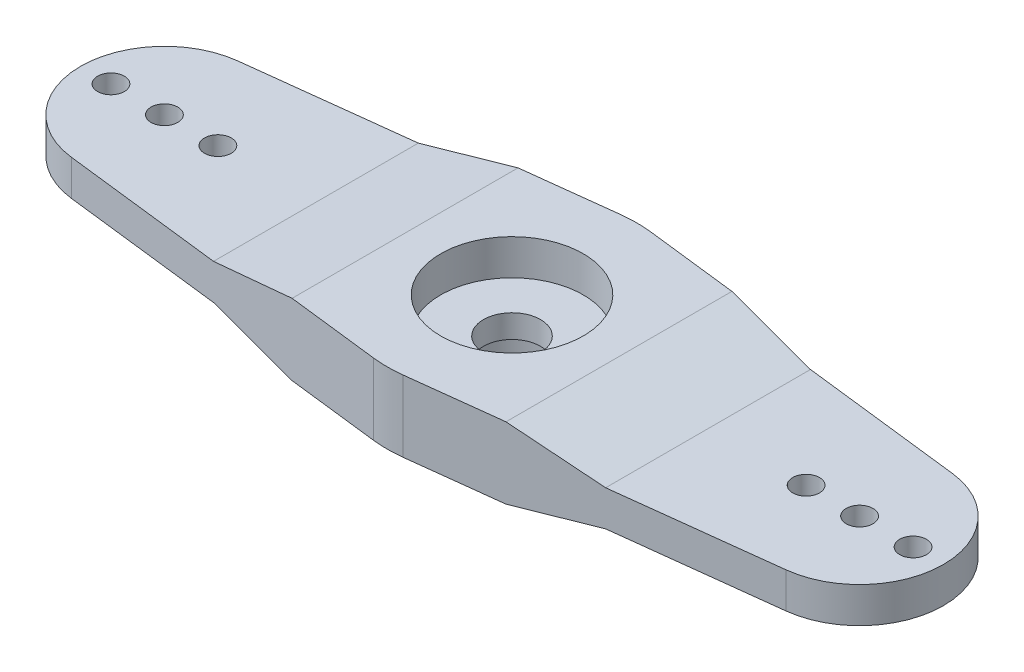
ISO-10303-21;
HEADER;
FILE_DESCRIPTION(('STEP AP214'),'2;1');
FILE_NAME('part.step','',(''),(''),'','','');
FILE_SCHEMA(('AUTOMOTIVE_DESIGN { 1 0 10303 214 1 1 1 1 }'));
ENDSEC;
DATA;
#1=APPLICATION_CONTEXT('core data for automotive mechanical design processes');
#2=APPLICATION_PROTOCOL_DEFINITION('international standard','automotive_design',2000,#1);
#3=PRODUCT_CONTEXT('',#1,'mechanical');
#4=PRODUCT('Part','Part','',(#3));
#5=PRODUCT_RELATED_PRODUCT_CATEGORY('part','',(#4));
#6=PRODUCT_DEFINITION_FORMATION('','',#4);
#7=PRODUCT_DEFINITION_CONTEXT('part definition',#1,'design');
#8=PRODUCT_DEFINITION('design','',#6,#7);
#9=PRODUCT_DEFINITION_SHAPE('','',#8);
#10=(LENGTH_UNIT() NAMED_UNIT(*) SI_UNIT(.MILLI.,.METRE.));
#11=(NAMED_UNIT(*) PLANE_ANGLE_UNIT() SI_UNIT($,.RADIAN.));
#12=(NAMED_UNIT(*) SI_UNIT($,.STERADIAN.) SOLID_ANGLE_UNIT());
#13=UNCERTAINTY_MEASURE_WITH_UNIT(LENGTH_MEASURE(1.E-05),#10,'distance_accuracy_value','');
#14=(GEOMETRIC_REPRESENTATION_CONTEXT(3) GLOBAL_UNCERTAINTY_ASSIGNED_CONTEXT((#13)) GLOBAL_UNIT_ASSIGNED_CONTEXT((#10,
#11,#12)) REPRESENTATION_CONTEXT('',''));
#15=CARTESIAN_POINT('',(0.,0.,0.));
#16=DIRECTION('',(0.,0.,1.));
#17=DIRECTION('',(1.,0.,0.));
#18=AXIS2_PLACEMENT_3D('',#15,#16,#17);
#19=CARTESIAN_POINT('',(0.823529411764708,0.,8.04861169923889));
#20=DIRECTION('',(0.117647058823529,0.,-0.993055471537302));
#21=DIRECTION('',(-0.993055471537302,0.,-0.117647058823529));
#22=AXIS2_PLACEMENT_3D('',#19,#20,#21);
#23=PLANE('',#22);
#24=DIRECTION('',(0.993055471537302,0.,0.117647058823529));
#25=VECTOR('',#24,1.);
#26=CARTESIAN_POINT('',(13.4237311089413,3.,9.54135476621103));
#27=LINE('',#26,#25);
#28=CARTESIAN_POINT('',(11.,3.,9.25421588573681));
#29=VERTEX_POINT('',#28);
#30=CARTESIAN_POINT('',(20.0536332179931,3.,10.3267977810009));
#31=VERTEX_POINT('',#30);
#32=EDGE_CURVE('E160',#29,#31,#27,.T.);
#33=ORIENTED_EDGE('',*,*,#32,.T.);
#34=DIRECTION('',(0.,1.,0.));
#35=VECTOR('',#34,1.);
#36=CARTESIAN_POINT('',(20.0536332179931,-2.,10.3267977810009));
#37=LINE('',#36,#35);
#38=CARTESIAN_POINT('',(20.0536332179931,1.,10.3267977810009));
#39=VERTEX_POINT('',#38);
#40=EDGE_CURVE('E147',#39,#31,#37,.T.);
#41=ORIENTED_EDGE('',*,*,#40,.F.);
#42=DIRECTION('',(-0.993055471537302,0.,-0.117647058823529));
#43=VECTOR('',#42,1.);
#44=CARTESIAN_POINT('',(13.4237311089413,1.,9.54135476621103));
#45=LINE('',#44,#43);
#46=CARTESIAN_POINT('',(11.,1.,9.2542158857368));
#47=VERTEX_POINT('',#46);
#48=EDGE_CURVE('E166',#39,#47,#45,.T.);
#49=ORIENTED_EDGE('',*,*,#48,.T.);
#50=DIRECTION('',(-0.974030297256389,-0.194806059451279,-0.115393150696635));
#51=VECTOR('',#50,1.);
#52=CARTESIAN_POINT('',(13.3317519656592,1.46635039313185,9.53045801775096));
#53=LINE('',#52,#51);
#54=CARTESIAN_POINT('',(5.99999999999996,0.,8.66186700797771));
#55=VERTEX_POINT('',#54);
#56=EDGE_CURVE('E168',#47,#55,#53,.T.);
#57=ORIENTED_EDGE('',*,*,#56,.T.);
#58=DIRECTION('',(-0.993055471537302,0.,-0.117647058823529));
#59=VECTOR('',#58,1.);
#60=CARTESIAN_POINT('',(0.823529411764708,0.,8.04861169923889));
#61=LINE('',#60,#59);
#62=CARTESIAN_POINT('',(0.823529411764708,0.,8.04861169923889));
#63=VERTEX_POINT('',#62);
#64=EDGE_CURVE('E326',#55,#63,#61,.T.);
#65=ORIENTED_EDGE('',*,*,#64,.T.);
#66=DIRECTION('',(0.,1.,0.));
#67=VECTOR('',#66,1.);
#68=CARTESIAN_POINT('',(0.823529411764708,0.,8.04861169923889));
#69=LINE('',#68,#67);
#70=CARTESIAN_POINT('',(0.823529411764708,4.,8.04861169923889));
#71=VERTEX_POINT('',#70);
#72=EDGE_CURVE('E278',#63,#71,#69,.T.);
#73=ORIENTED_EDGE('',*,*,#72,.T.);
#74=DIRECTION('',(-0.993055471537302,0.,-0.117647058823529));
#75=VECTOR('',#74,1.);
#76=CARTESIAN_POINT('',(0.823529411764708,4.,8.04861169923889));
#77=LINE('',#76,#75);
#78=CARTESIAN_POINT('',(6.,4.,8.66186700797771));
#79=VERTEX_POINT('',#78);
#80=EDGE_CURVE('E291',#79,#71,#77,.T.);
#81=ORIENTED_EDGE('',*,*,#80,.F.);
#82=DIRECTION('',(0.974030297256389,-0.194806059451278,0.115393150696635));
#83=VECTOR('',#82,1.);
#84=CARTESIAN_POINT('',(8.39832986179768,3.52033402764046,8.94599660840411));
#85=LINE('',#84,#83);
#86=EDGE_CURVE('E165',#79,#29,#85,.T.);
#87=ORIENTED_EDGE('',*,*,#86,.T.);
#88=EDGE_LOOP('',(#33,#41,#49,#57,#65,#73,#81,#87));
#89=FACE_BOUND('',#88,.T.);
#90=ADVANCED_FACE('F37',(#89),#23,.T.);
#91=CARTESIAN_POINT('',(-0.823529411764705,0.,21.9513883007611));
#92=DIRECTION('',(-0.117647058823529,0.,0.993055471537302));
#93=DIRECTION('',(0.993055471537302,0.,0.117647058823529));
#94=AXIS2_PLACEMENT_3D('',#91,#92,#93);
#95=PLANE('',#94);
#96=DIRECTION('',(-0.993055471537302,0.,-0.117647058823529));
#97=VECTOR('',#96,1.);
#98=CARTESIAN_POINT('',(-28.6558536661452,3.,18.6540990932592));
#99=LINE('',#98,#97);
#100=CARTESIAN_POINT('',(-11.,3.,20.7457841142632));
#101=VERTEX_POINT('',#100);
#102=CARTESIAN_POINT('',(-20.0536332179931,3.,19.6732022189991));
#103=VERTEX_POINT('',#102);
#104=EDGE_CURVE('E188',#101,#103,#99,.T.);
#105=ORIENTED_EDGE('',*,*,#104,.T.);
#106=DIRECTION('',(0.,1.,0.));
#107=VECTOR('',#106,1.);
#108=CARTESIAN_POINT('',(-20.0536332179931,-2.,19.6732022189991));
#109=LINE('',#108,#107);
#110=CARTESIAN_POINT('',(-20.0536332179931,1.,19.6732022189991));
#111=VERTEX_POINT('',#110);
#112=EDGE_CURVE('E362',#111,#103,#109,.T.);
#113=ORIENTED_EDGE('',*,*,#112,.F.);
#114=DIRECTION('',(0.993055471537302,0.,0.117647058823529));
#115=VECTOR('',#114,1.);
#116=CARTESIAN_POINT('',(-28.6558536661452,1.,18.6540990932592));
#117=LINE('',#116,#115);
#118=CARTESIAN_POINT('',(-11.,1.,20.7457841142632));
#119=VERTEX_POINT('',#118);
#120=EDGE_CURVE('E186',#111,#119,#117,.T.);
#121=ORIENTED_EDGE('',*,*,#120,.T.);
#122=DIRECTION('',(0.974030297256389,-0.194806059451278,0.115393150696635));
#123=VECTOR('',#122,1.);
#124=CARTESIAN_POINT('',(-5.02643711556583,-0.194712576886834,21.4534707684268));
#125=LINE('',#124,#123);
#126=CARTESIAN_POINT('',(-6.,0.,21.3381329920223));
#127=VERTEX_POINT('',#126);
#128=EDGE_CURVE('E184',#119,#127,#125,.T.);
#129=ORIENTED_EDGE('',*,*,#128,.T.);
#130=DIRECTION('',(0.993055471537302,0.,0.117647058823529));
#131=VECTOR('',#130,1.);
#132=CARTESIAN_POINT('',(-0.823529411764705,0.,21.9513883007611));
#133=LINE('',#132,#131);
#134=CARTESIAN_POINT('',(-0.823529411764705,0.,21.9513883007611));
#135=VERTEX_POINT('',#134);
#136=EDGE_CURVE('E270',#127,#135,#133,.T.);
#137=ORIENTED_EDGE('',*,*,#136,.T.);
#138=DIRECTION('',(0.,1.,0.));
#139=VECTOR('',#138,1.);
#140=CARTESIAN_POINT('',(-0.823529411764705,0.,21.9513883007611));
#141=LINE('',#140,#139);
#142=CARTESIAN_POINT('',(-0.823529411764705,4.,21.9513883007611));
#143=VERTEX_POINT('',#142);
#144=EDGE_CURVE('E303',#135,#143,#141,.T.);
#145=ORIENTED_EDGE('',*,*,#144,.T.);
#146=DIRECTION('',(0.993055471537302,0.,0.117647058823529));
#147=VECTOR('',#146,1.);
#148=CARTESIAN_POINT('',(-0.823529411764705,4.,21.9513883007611));
#149=LINE('',#148,#147);
#150=CARTESIAN_POINT('',(-6.,4.,21.3381329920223));
#151=VERTEX_POINT('',#150);
#152=EDGE_CURVE('E300',#151,#143,#149,.T.);
#153=ORIENTED_EDGE('',*,*,#152,.F.);
#154=DIRECTION('',(-0.974030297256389,-0.194806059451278,-0.115393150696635));
#155=VECTOR('',#154,1.);
#156=CARTESIAN_POINT('',(-9.95985921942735,3.20802815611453,20.8690093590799));
#157=LINE('',#156,#155);
#158=EDGE_CURVE('E191',#151,#101,#157,.T.);
#159=ORIENTED_EDGE('',*,*,#158,.T.);
#160=EDGE_LOOP('',(#105,#113,#121,#129,#137,#145,#153,#159));
#161=FACE_BOUND('',#160,.T.);
#162=ADVANCED_FACE('F377',(#161),#95,.T.);
#163=CARTESIAN_POINT('',(-6.,0.,30.));
#164=DIRECTION('',(0.,1.,0.));
#165=DIRECTION('',(0.,0.,1.));
#166=AXIS2_PLACEMENT_3D('',#163,#164,#165);
#167=PLANE('',#166);
#168=DIRECTION('',(-0.993055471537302,0.,0.117647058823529));
#169=VECTOR('',#168,1.);
#170=CARTESIAN_POINT('',(-25.9705882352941,0.,11.0277781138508));
#171=LINE('',#170,#169);
#172=CARTESIAN_POINT('',(-0.823529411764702,0.,8.04861169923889));
#173=VERTEX_POINT('',#172);
#174=CARTESIAN_POINT('',(-6.,0.,8.66186700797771));
#175=VERTEX_POINT('',#174);
#176=EDGE_CURVE('E259',#173,#175,#171,.T.);
#177=ORIENTED_EDGE('',*,*,#176,.F.);
#178=CARTESIAN_POINT('',(0.,0.,15.));
#179=DIRECTION('',(0.,1.,0.));
#180=DIRECTION('',(0.,0.,1.));
#181=AXIS2_PLACEMENT_3D('',#178,#179,#180);
#182=CIRCLE('',#181,7.);
#183=EDGE_CURVE('E280',#63,#173,#182,.T.);
#184=ORIENTED_EDGE('',*,*,#183,.F.);
#185=ORIENTED_EDGE('',*,*,#64,.F.);
#186=DIRECTION('',(0.,0.,-1.));
#187=VECTOR('',#186,1.);
#188=CARTESIAN_POINT('',(6.,0.,30.));
#189=LINE('',#188,#187);
#190=CARTESIAN_POINT('',(6.00000000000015,0.,21.3381329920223));
#191=VERTEX_POINT('',#190);
#192=EDGE_CURVE('E204',#191,#55,#189,.T.);
#193=ORIENTED_EDGE('',*,*,#192,.F.);
#194=DIRECTION('',(0.993055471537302,0.,-0.117647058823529));
#195=VECTOR('',#194,1.);
#196=CARTESIAN_POINT('',(25.9705882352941,0.,18.9722218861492));
#197=LINE('',#196,#195);
#198=CARTESIAN_POINT('',(0.823529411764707,0.,21.9513883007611));
#199=VERTEX_POINT('',#198);
#200=EDGE_CURVE('E317',#199,#191,#197,.T.);
#201=ORIENTED_EDGE('',*,*,#200,.F.);
#202=CARTESIAN_POINT('',(0.,0.,15.));
#203=DIRECTION('',(0.,1.,0.));
#204=DIRECTION('',(0.,0.,1.));
#205=AXIS2_PLACEMENT_3D('',#202,#203,#204);
#206=CIRCLE('',#205,7.);
#207=EDGE_CURVE('E273',#135,#199,#206,.T.);
#208=ORIENTED_EDGE('',*,*,#207,.F.);
#209=ORIENTED_EDGE('',*,*,#136,.F.);
#210=DIRECTION('',(0.,0.,-1.));
#211=VECTOR('',#210,1.);
#212=CARTESIAN_POINT('',(-6.,0.,30.));
#213=LINE('',#212,#211);
#214=EDGE_CURVE('E207',#127,#175,#213,.T.);
#215=ORIENTED_EDGE('',*,*,#214,.T.);
#216=EDGE_LOOP('',(#177,#184,#185,#193,#201,#208,#209,#215));
#217=FACE_BOUND('',#216,.T.);
#218=CARTESIAN_POINT('',(0.,0.,15.));
#219=DIRECTION('',(0.,1.,0.));
#220=DIRECTION('',(0.,0.,1.));
#221=AXIS2_PLACEMENT_3D('',#218,#219,#220);
#222=CIRCLE('',#221,5.);
#223=CARTESIAN_POINT('',(0.,0.,20.));
#224=VERTEX_POINT('',#223);
#225=EDGE_CURVE('E216',#224,#224,#222,.F.);
#226=ORIENTED_EDGE('',*,*,#225,.F.);
#227=EDGE_LOOP('',(#226));
#228=FACE_BOUND('',#227,.T.);
#229=ADVANCED_FACE('F266',(#217,#228),#167,.F.);
#230=CARTESIAN_POINT('',(-30.,3.,30.));
#231=DIRECTION('',(0.,-1.,0.));
#232=DIRECTION('',(0.,0.,-1.));
#233=AXIS2_PLACEMENT_3D('',#230,#231,#232);
#234=PLANE('',#233);
#235=CARTESIAN_POINT('',(-22.5,3.,15.));
#236=DIRECTION('',(0.,1.,0.));
#237=DIRECTION('',(0.,0.,1.));
#238=AXIS2_PLACEMENT_3D('',#235,#236,#237);
#239=CIRCLE('',#238,0.750000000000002);
#240=CARTESIAN_POINT('',(-22.5,3.,15.75));
#241=VERTEX_POINT('',#240);
#242=EDGE_CURVE('E231',#241,#241,#239,.T.);
#243=ORIENTED_EDGE('',*,*,#242,.F.);
#244=EDGE_LOOP('',(#243));
#245=FACE_BOUND('',#244,.T.);
#246=CARTESIAN_POINT('',(-19.5,3.,15.));
#247=DIRECTION('',(0.,1.,0.));
#248=DIRECTION('',(0.,0.,1.));
#249=AXIS2_PLACEMENT_3D('',#246,#247,#248);
#250=CIRCLE('',#249,0.750000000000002);
#251=CARTESIAN_POINT('',(-19.5,3.,15.75));
#252=VERTEX_POINT('',#251);
#253=EDGE_CURVE('E227',#252,#252,#250,.T.);
#254=ORIENTED_EDGE('',*,*,#253,.F.);
#255=EDGE_LOOP('',(#254));
#256=FACE_BOUND('',#255,.T.);
#257=CARTESIAN_POINT('',(-16.5,3.,15.));
#258=DIRECTION('',(0.,1.,0.));
#259=DIRECTION('',(0.,0.,1.));
#260=AXIS2_PLACEMENT_3D('',#257,#258,#259);
#261=CIRCLE('',#260,0.750000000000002);
#262=CARTESIAN_POINT('',(-16.5,3.,15.75));
#263=VERTEX_POINT('',#262);
#264=EDGE_CURVE('E223',#263,#263,#261,.T.);
#265=ORIENTED_EDGE('',*,*,#264,.F.);
#266=EDGE_LOOP('',(#265));
#267=FACE_BOUND('',#266,.T.);
#268=DIRECTION('',(0.993055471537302,0.,-0.117647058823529));
#269=VECTOR('',#268,1.);
#270=CARTESIAN_POINT('',(-32.1607553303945,3.,11.7611258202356));
#271=LINE('',#270,#269);
#272=CARTESIAN_POINT('',(-20.0536332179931,3.,10.3267977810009));
#273=VERTEX_POINT('',#272);
#274=CARTESIAN_POINT('',(-11.,3.,9.2542158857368));
#275=VERTEX_POINT('',#274);
#276=EDGE_CURVE('E180',#273,#275,#271,.T.);
#277=ORIENTED_EDGE('',*,*,#276,.F.);
#278=CARTESIAN_POINT('',(-19.5,3.,15.));
#279=DIRECTION('',(0.,-1.,0.));
#280=DIRECTION('',(0.,0.,1.));
#281=AXIS2_PLACEMENT_3D('',#278,#279,#280);
#282=CIRCLE('',#281,4.70588235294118);
#283=EDGE_CURVE('E364',#103,#273,#282,.T.);
#284=ORIENTED_EDGE('',*,*,#283,.F.);
#285=ORIENTED_EDGE('',*,*,#104,.F.);
#286=DIRECTION('',(0.,0.,-1.));
#287=VECTOR('',#286,1.);
#288=CARTESIAN_POINT('',(-11.,3.,30.));
#289=LINE('',#288,#287);
#290=EDGE_CURVE('E213',#101,#275,#289,.T.);
#291=ORIENTED_EDGE('',*,*,#290,.T.);
#292=EDGE_LOOP('',(#277,#284,#285,#291));
#293=FACE_BOUND('',#292,.T.);
#294=ADVANCED_FACE('F387',(#245,#256,#267,#293),#234,.F.);
#295=CARTESIAN_POINT('',(-6.,4.,30.));
#296=DIRECTION('',(0.,-1.,0.));
#297=DIRECTION('',(0.,0.,-1.));
#298=AXIS2_PLACEMENT_3D('',#295,#296,#297);
#299=PLANE('',#298);
#300=CARTESIAN_POINT('',(0.,4.,15.));
#301=DIRECTION('',(0.,1.,0.));
#302=DIRECTION('',(0.,0.,1.));
#303=AXIS2_PLACEMENT_3D('',#300,#301,#302);
#304=CIRCLE('',#303,4.);
#305=CARTESIAN_POINT('',(0.,4.,19.));
#306=VERTEX_POINT('',#305);
#307=EDGE_CURVE('E333',#306,#306,#304,.T.);
#308=ORIENTED_EDGE('',*,*,#307,.F.);
#309=EDGE_LOOP('',(#308));
#310=FACE_BOUND('',#309,.T.);
#311=DIRECTION('',(-0.993055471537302,0.,0.117647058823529));
#312=VECTOR('',#311,1.);
#313=CARTESIAN_POINT('',(-25.9705882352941,4.,11.0277781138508));
#314=LINE('',#313,#312);
#315=CARTESIAN_POINT('',(-0.823529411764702,4.,8.04861169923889));
#316=VERTEX_POINT('',#315);
#317=CARTESIAN_POINT('',(-6.,4.,8.66186700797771));
#318=VERTEX_POINT('',#317);
#319=EDGE_CURVE('E297',#316,#318,#314,.T.);
#320=ORIENTED_EDGE('',*,*,#319,.T.);
#321=DIRECTION('',(0.,0.,-1.));
#322=VECTOR('',#321,1.);
#323=CARTESIAN_POINT('',(-6.,4.,30.));
#324=LINE('',#323,#322);
#325=EDGE_CURVE('E193',#151,#318,#324,.T.);
#326=ORIENTED_EDGE('',*,*,#325,.F.);
#327=ORIENTED_EDGE('',*,*,#152,.T.);
#328=CARTESIAN_POINT('',(0.,4.,15.));
#329=DIRECTION('',(0.,1.,0.));
#330=DIRECTION('',(0.,0.,1.));
#331=AXIS2_PLACEMENT_3D('',#328,#329,#330);
#332=CIRCLE('',#331,7.);
#333=CARTESIAN_POINT('',(0.823529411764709,4.,21.9513883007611));
#334=VERTEX_POINT('',#333);
#335=EDGE_CURVE('E284',#143,#334,#332,.T.);
#336=ORIENTED_EDGE('',*,*,#335,.T.);
#337=DIRECTION('',(0.993055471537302,0.,-0.117647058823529));
#338=VECTOR('',#337,1.);
#339=CARTESIAN_POINT('',(25.9705882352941,4.,18.9722218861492));
#340=LINE('',#339,#338);
#341=CARTESIAN_POINT('',(6.,4.,21.3381329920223));
#342=VERTEX_POINT('',#341);
#343=EDGE_CURVE('E287',#334,#342,#340,.T.);
#344=ORIENTED_EDGE('',*,*,#343,.T.);
#345=DIRECTION('',(0.,0.,-1.));
#346=VECTOR('',#345,1.);
#347=CARTESIAN_POINT('',(6.,4.,30.));
#348=LINE('',#347,#346);
#349=EDGE_CURVE('E196',#342,#79,#348,.T.);
#350=ORIENTED_EDGE('',*,*,#349,.T.);
#351=ORIENTED_EDGE('',*,*,#80,.T.);
#352=CARTESIAN_POINT('',(0.,4.,15.));
#353=DIRECTION('',(0.,1.,0.));
#354=DIRECTION('',(0.,0.,1.));
#355=AXIS2_PLACEMENT_3D('',#352,#353,#354);
#356=CIRCLE('',#355,7.);
#357=EDGE_CURVE('E294',#71,#316,#356,.T.);
#358=ORIENTED_EDGE('',*,*,#357,.T.);
#359=EDGE_LOOP('',(#320,#326,#327,#336,#344,#350,#351,#358));
#360=FACE_BOUND('',#359,.T.);
#361=ADVANCED_FACE('F373',(#310,#360),#299,.F.);
#362=CARTESIAN_POINT('',(6.,4.,30.));
#363=DIRECTION('',(-0.196116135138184,-0.98058067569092,0.));
#364=DIRECTION('',(0.98058067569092,-0.196116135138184,0.));
#365=AXIS2_PLACEMENT_3D('',#362,#363,#364);
#366=PLANE('',#365);
#367=ORIENTED_EDGE('',*,*,#86,.F.);
#368=ORIENTED_EDGE('',*,*,#349,.F.);
#369=DIRECTION('',(-0.974030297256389,0.194806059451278,0.115393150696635));
#370=VECTOR('',#369,1.);
#371=CARTESIAN_POINT('',(5.02643711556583,4.19471257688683,21.4534707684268));
#372=LINE('',#371,#370);
#373=CARTESIAN_POINT('',(11.,3.,20.7457841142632));
#374=VERTEX_POINT('',#373);
#375=EDGE_CURVE('E305',#374,#342,#372,.T.);
#376=ORIENTED_EDGE('',*,*,#375,.F.);
#377=DIRECTION('',(0.,0.,-1.));
#378=VECTOR('',#377,1.);
#379=CARTESIAN_POINT('',(11.,3.,30.));
#380=LINE('',#379,#378);
#381=EDGE_CURVE('E199',#374,#29,#380,.T.);
#382=ORIENTED_EDGE('',*,*,#381,.T.);
#383=EDGE_LOOP('',(#367,#368,#376,#382));
#384=FACE_BOUND('',#383,.T.);
#385=ADVANCED_FACE('F371',(#384),#366,.F.);
#386=CARTESIAN_POINT('',(11.,3.,30.));
#387=DIRECTION('',(0.,-1.,0.));
#388=DIRECTION('',(0.,0.,-1.));
#389=AXIS2_PLACEMENT_3D('',#386,#387,#388);
#390=PLANE('',#389);
#391=CARTESIAN_POINT('',(22.5,3.,15.));
#392=DIRECTION('',(0.,1.,0.));
#393=DIRECTION('',(0.,0.,1.));
#394=AXIS2_PLACEMENT_3D('',#391,#392,#393);
#395=CIRCLE('',#394,0.750000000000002);
#396=CARTESIAN_POINT('',(22.5,3.,15.75));
#397=VERTEX_POINT('',#396);
#398=EDGE_CURVE('E243',#397,#397,#395,.T.);
#399=ORIENTED_EDGE('',*,*,#398,.F.);
#400=EDGE_LOOP('',(#399));
#401=FACE_BOUND('',#400,.T.);
#402=CARTESIAN_POINT('',(19.5,3.,15.));
#403=DIRECTION('',(0.,1.,0.));
#404=DIRECTION('',(0.,0.,1.));
#405=AXIS2_PLACEMENT_3D('',#402,#403,#404);
#406=CIRCLE('',#405,0.750000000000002);
#407=CARTESIAN_POINT('',(19.5,3.,15.75));
#408=VERTEX_POINT('',#407);
#409=EDGE_CURVE('E239',#408,#408,#406,.T.);
#410=ORIENTED_EDGE('',*,*,#409,.F.);
#411=EDGE_LOOP('',(#410));
#412=FACE_BOUND('',#411,.T.);
#413=CARTESIAN_POINT('',(16.5,3.,15.));
#414=DIRECTION('',(0.,1.,0.));
#415=DIRECTION('',(0.,0.,1.));
#416=AXIS2_PLACEMENT_3D('',#413,#414,#415);
#417=CIRCLE('',#416,0.750000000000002);
#418=CARTESIAN_POINT('',(16.5,3.,15.75));
#419=VERTEX_POINT('',#418);
#420=EDGE_CURVE('E235',#419,#419,#417,.T.);
#421=ORIENTED_EDGE('',*,*,#420,.F.);
#422=EDGE_LOOP('',(#421));
#423=FACE_BOUND('',#422,.T.);
#424=DIRECTION('',(-0.993055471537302,0.,0.117647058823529));
#425=VECTOR('',#424,1.);
#426=CARTESIAN_POINT('',(9.91882944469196,3.,20.8738701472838));
#427=LINE('',#426,#425);
#428=CARTESIAN_POINT('',(20.0536332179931,3.,19.6732022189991));
#429=VERTEX_POINT('',#428);
#430=EDGE_CURVE('E162',#429,#374,#427,.T.);
#431=ORIENTED_EDGE('',*,*,#430,.F.);
#432=CARTESIAN_POINT('',(19.5,3.,15.));
#433=DIRECTION('',(0.,-1.,0.));
#434=DIRECTION('',(0.,0.,1.));
#435=AXIS2_PLACEMENT_3D('',#432,#433,#434);
#436=CIRCLE('',#435,4.70588235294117);
#437=EDGE_CURVE('E150',#31,#429,#436,.T.);
#438=ORIENTED_EDGE('',*,*,#437,.F.);
#439=ORIENTED_EDGE('',*,*,#32,.F.);
#440=ORIENTED_EDGE('',*,*,#381,.F.);
#441=EDGE_LOOP('',(#431,#438,#439,#440));
#442=FACE_BOUND('',#441,.T.);
#443=ADVANCED_FACE('F158',(#401,#412,#423,#442),#390,.F.);
#444=CARTESIAN_POINT('',(-11.,3.,30.));
#445=DIRECTION('',(0.196116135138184,-0.98058067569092,0.));
#446=DIRECTION('',(0.98058067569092,0.196116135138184,0.));
#447=AXIS2_PLACEMENT_3D('',#444,#445,#446);
#448=PLANE('',#447);
#449=ORIENTED_EDGE('',*,*,#158,.F.);
#450=ORIENTED_EDGE('',*,*,#325,.T.);
#451=DIRECTION('',(0.974030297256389,0.194806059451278,-0.115393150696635));
#452=VECTOR('',#451,1.);
#453=CARTESIAN_POINT('',(-13.3317519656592,2.53364960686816,9.53045801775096));
#454=LINE('',#453,#452);
#455=EDGE_CURVE('E182',#275,#318,#454,.T.);
#456=ORIENTED_EDGE('',*,*,#455,.F.);
#457=ORIENTED_EDGE('',*,*,#290,.F.);
#458=EDGE_LOOP('',(#449,#450,#456,#457));
#459=FACE_BOUND('',#458,.T.);
#460=ADVANCED_FACE('F39',(#459),#448,.F.);
#461=CARTESIAN_POINT('',(-25.9705882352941,0.,11.0277781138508));
#462=DIRECTION('',(-0.117647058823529,0.,-0.993055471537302));
#463=DIRECTION('',(-0.993055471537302,0.,0.117647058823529));
#464=AXIS2_PLACEMENT_3D('',#461,#462,#463);
#465=PLANE('',#464);
#466=DIRECTION('',(0.,1.,0.));
#467=VECTOR('',#466,1.);
#468=CARTESIAN_POINT('',(-20.0536332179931,-2.,10.3267977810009));
#469=LINE('',#468,#467);
#470=CARTESIAN_POINT('',(-20.0536332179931,1.,10.3267977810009));
#471=VERTEX_POINT('',#470);
#472=EDGE_CURVE('E59',#471,#273,#469,.T.);
#473=ORIENTED_EDGE('',*,*,#472,.T.);
#474=ORIENTED_EDGE('',*,*,#276,.T.);
#475=ORIENTED_EDGE('',*,*,#455,.T.);
#476=ORIENTED_EDGE('',*,*,#319,.F.);
#477=DIRECTION('',(0.,1.,0.));
#478=VECTOR('',#477,1.);
#479=CARTESIAN_POINT('',(-0.823529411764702,0.,8.04861169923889));
#480=LINE('',#479,#478);
#481=EDGE_CURVE('E306',#173,#316,#480,.T.);
#482=ORIENTED_EDGE('',*,*,#481,.F.);
#483=ORIENTED_EDGE('',*,*,#176,.T.);
#484=DIRECTION('',(-0.974030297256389,0.194806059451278,0.115393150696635));
#485=VECTOR('',#484,1.);
#486=CARTESIAN_POINT('',(-8.39832986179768,0.479665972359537,8.94599660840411));
#487=LINE('',#486,#485);
#488=CARTESIAN_POINT('',(-11.,1.,9.25421588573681));
#489=VERTEX_POINT('',#488);
#490=EDGE_CURVE('E175',#175,#489,#487,.T.);
#491=ORIENTED_EDGE('',*,*,#490,.T.);
#492=DIRECTION('',(-0.993055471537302,0.,0.117647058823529));
#493=VECTOR('',#492,1.);
#494=CARTESIAN_POINT('',(-32.1607553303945,1.,11.7611258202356));
#495=LINE('',#494,#493);
#496=EDGE_CURVE('E177',#489,#471,#495,.T.);
#497=ORIENTED_EDGE('',*,*,#496,.T.);
#498=EDGE_LOOP('',(#473,#474,#475,#476,#482,#483,#491,#497));
#499=FACE_BOUND('',#498,.T.);
#500=ADVANCED_FACE('F255',(#499),#465,.T.);
#501=CARTESIAN_POINT('',(25.9705882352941,0.,18.9722218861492));
#502=DIRECTION('',(0.117647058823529,0.,0.993055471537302));
#503=DIRECTION('',(0.993055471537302,0.,-0.117647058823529));
#504=AXIS2_PLACEMENT_3D('',#501,#502,#503);
#505=PLANE('',#504);
#506=DIRECTION('',(0.,1.,0.));
#507=VECTOR('',#506,1.);
#508=CARTESIAN_POINT('',(20.0536332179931,-2.,19.6732022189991));
#509=LINE('',#508,#507);
#510=CARTESIAN_POINT('',(20.0536332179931,1.,19.6732022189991));
#511=VERTEX_POINT('',#510);
#512=EDGE_CURVE('E52',#511,#429,#509,.T.);
#513=ORIENTED_EDGE('',*,*,#512,.T.);
#514=ORIENTED_EDGE('',*,*,#430,.T.);
#515=ORIENTED_EDGE('',*,*,#375,.T.);
#516=ORIENTED_EDGE('',*,*,#343,.F.);
#517=DIRECTION('',(0.,1.,0.));
#518=VECTOR('',#517,1.);
#519=CARTESIAN_POINT('',(0.823529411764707,0.,21.9513883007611));
#520=LINE('',#519,#518);
#521=EDGE_CURVE('E276',#199,#334,#520,.T.);
#522=ORIENTED_EDGE('',*,*,#521,.F.);
#523=ORIENTED_EDGE('',*,*,#200,.T.);
#524=DIRECTION('',(0.974030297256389,0.194806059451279,-0.115393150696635));
#525=VECTOR('',#524,1.);
#526=CARTESIAN_POINT('',(9.95985921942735,0.791971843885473,20.8690093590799));
#527=LINE('',#526,#525);
#528=CARTESIAN_POINT('',(11.,1.,20.7457841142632));
#529=VERTEX_POINT('',#528);
#530=EDGE_CURVE('E170',#191,#529,#527,.T.);
#531=ORIENTED_EDGE('',*,*,#530,.T.);
#532=DIRECTION('',(0.993055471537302,0.,-0.117647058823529));
#533=VECTOR('',#532,1.);
#534=CARTESIAN_POINT('',(9.91882944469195,1.,20.8738701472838));
#535=LINE('',#534,#533);
#536=EDGE_CURVE('E311',#529,#511,#535,.T.);
#537=ORIENTED_EDGE('',*,*,#536,.T.);
#538=EDGE_LOOP('',(#513,#514,#515,#516,#522,#523,#531,#537));
#539=FACE_BOUND('',#538,.T.);
#540=ADVANCED_FACE('F316',(#539),#505,.T.);
#541=CARTESIAN_POINT('',(0.,0.,15.));
#542=DIRECTION('',(0.,1.,0.));
#543=DIRECTION('',(0.,0.,1.));
#544=AXIS2_PLACEMENT_3D('',#541,#542,#543);
#545=CYLINDRICAL_SURFACE('',#544,7.);
#546=ORIENTED_EDGE('',*,*,#335,.F.);
#547=ORIENTED_EDGE('',*,*,#144,.F.);
#548=ORIENTED_EDGE('',*,*,#207,.T.);
#549=ORIENTED_EDGE('',*,*,#521,.T.);
#550=EDGE_LOOP('',(#546,#547,#548,#549));
#551=FACE_BOUND('',#550,.T.);
#552=ADVANCED_FACE('F376',(#551),#545,.T.);
#553=CARTESIAN_POINT('',(0.,0.,15.));
#554=DIRECTION('',(0.,1.,0.));
#555=DIRECTION('',(0.,0.,1.));
#556=AXIS2_PLACEMENT_3D('',#553,#554,#555);
#557=CYLINDRICAL_SURFACE('',#556,7.);
#558=ORIENTED_EDGE('',*,*,#357,.F.);
#559=ORIENTED_EDGE('',*,*,#72,.F.);
#560=ORIENTED_EDGE('',*,*,#183,.T.);
#561=ORIENTED_EDGE('',*,*,#481,.T.);
#562=EDGE_LOOP('',(#558,#559,#560,#561));
#563=FACE_BOUND('',#562,.T.);
#564=ADVANCED_FACE('F409',(#563),#557,.T.);
#565=CARTESIAN_POINT('',(-30.,1.,30.));
#566=DIRECTION('',(0.,1.,0.));
#567=DIRECTION('',(0.,0.,1.));
#568=AXIS2_PLACEMENT_3D('',#565,#566,#567);
#569=PLANE('',#568);
#570=CARTESIAN_POINT('',(-22.5,1.,15.));
#571=DIRECTION('',(0.,1.,0.));
#572=DIRECTION('',(0.,0.,1.));
#573=AXIS2_PLACEMENT_3D('',#570,#571,#572);
#574=CIRCLE('',#573,0.750000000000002);
#575=CARTESIAN_POINT('',(-22.5,1.,15.75));
#576=VERTEX_POINT('',#575);
#577=EDGE_CURVE('E228',#576,#576,#574,.T.);
#578=ORIENTED_EDGE('',*,*,#577,.T.);
#579=EDGE_LOOP('',(#578));
#580=FACE_BOUND('',#579,.T.);
#581=CARTESIAN_POINT('',(-19.5,1.,15.));
#582=DIRECTION('',(0.,1.,0.));
#583=DIRECTION('',(0.,0.,1.));
#584=AXIS2_PLACEMENT_3D('',#581,#582,#583);
#585=CIRCLE('',#584,0.750000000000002);
#586=CARTESIAN_POINT('',(-19.5,1.,15.75));
#587=VERTEX_POINT('',#586);
#588=EDGE_CURVE('E224',#587,#587,#585,.T.);
#589=ORIENTED_EDGE('',*,*,#588,.T.);
#590=EDGE_LOOP('',(#589));
#591=FACE_BOUND('',#590,.T.);
#592=CARTESIAN_POINT('',(-16.5,1.,15.));
#593=DIRECTION('',(0.,1.,0.));
#594=DIRECTION('',(0.,0.,1.));
#595=AXIS2_PLACEMENT_3D('',#592,#593,#594);
#596=CIRCLE('',#595,0.750000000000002);
#597=CARTESIAN_POINT('',(-16.5,1.,15.75));
#598=VERTEX_POINT('',#597);
#599=EDGE_CURVE('E219',#598,#598,#596,.T.);
#600=ORIENTED_EDGE('',*,*,#599,.T.);
#601=EDGE_LOOP('',(#600));
#602=FACE_BOUND('',#601,.T.);
#603=ORIENTED_EDGE('',*,*,#120,.F.);
#604=CARTESIAN_POINT('',(-19.5,1.,15.));
#605=DIRECTION('',(0.,1.,0.));
#606=DIRECTION('',(0.,0.,1.));
#607=AXIS2_PLACEMENT_3D('',#604,#605,#606);
#608=CIRCLE('',#607,4.70588235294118);
#609=EDGE_CURVE('E45',#111,#471,#608,.F.);
#610=ORIENTED_EDGE('',*,*,#609,.T.);
#611=ORIENTED_EDGE('',*,*,#496,.F.);
#612=DIRECTION('',(0.,0.,-1.));
#613=VECTOR('',#612,1.);
#614=CARTESIAN_POINT('',(-11.,1.,30.));
#615=LINE('',#614,#613);
#616=EDGE_CURVE('E210',#119,#489,#615,.T.);
#617=ORIENTED_EDGE('',*,*,#616,.F.);
#618=EDGE_LOOP('',(#603,#610,#611,#617));
#619=FACE_BOUND('',#618,.T.);
#620=ADVANCED_FACE('F251',(#580,#591,#602,#619),#569,.F.);
#621=CARTESIAN_POINT('',(-6.,0.,30.));
#622=DIRECTION('',(0.196116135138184,0.98058067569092,0.));
#623=DIRECTION('',(-0.98058067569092,0.196116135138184,0.));
#624=AXIS2_PLACEMENT_3D('',#621,#622,#623);
#625=PLANE('',#624);
#626=ORIENTED_EDGE('',*,*,#128,.F.);
#627=ORIENTED_EDGE('',*,*,#616,.T.);
#628=ORIENTED_EDGE('',*,*,#490,.F.);
#629=ORIENTED_EDGE('',*,*,#214,.F.);
#630=EDGE_LOOP('',(#626,#627,#628,#629));
#631=FACE_BOUND('',#630,.T.);
#632=ADVANCED_FACE('F263',(#631),#625,.F.);
#633=CARTESIAN_POINT('',(11.,1.,30.));
#634=DIRECTION('',(-0.196116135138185,0.98058067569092,0.));
#635=DIRECTION('',(-0.98058067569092,-0.196116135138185,0.));
#636=AXIS2_PLACEMENT_3D('',#633,#634,#635);
#637=PLANE('',#636);
#638=ORIENTED_EDGE('',*,*,#56,.F.);
#639=DIRECTION('',(0.,0.,-1.));
#640=VECTOR('',#639,1.);
#641=CARTESIAN_POINT('',(11.,1.,30.));
#642=LINE('',#641,#640);
#643=EDGE_CURVE('E201',#529,#47,#642,.T.);
#644=ORIENTED_EDGE('',*,*,#643,.F.);
#645=ORIENTED_EDGE('',*,*,#530,.F.);
#646=ORIENTED_EDGE('',*,*,#192,.T.);
#647=EDGE_LOOP('',(#638,#644,#645,#646));
#648=FACE_BOUND('',#647,.T.);
#649=ADVANCED_FACE('F324',(#648),#637,.F.);
#650=CARTESIAN_POINT('',(11.,1.,30.));
#651=DIRECTION('',(0.,1.,0.));
#652=DIRECTION('',(0.,0.,1.));
#653=AXIS2_PLACEMENT_3D('',#650,#651,#652);
#654=PLANE('',#653);
#655=CARTESIAN_POINT('',(22.5,1.,15.));
#656=DIRECTION('',(0.,1.,0.));
#657=DIRECTION('',(0.,0.,1.));
#658=AXIS2_PLACEMENT_3D('',#655,#656,#657);
#659=CIRCLE('',#658,0.750000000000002);
#660=CARTESIAN_POINT('',(22.5,1.,15.75));
#661=VERTEX_POINT('',#660);
#662=EDGE_CURVE('E240',#661,#661,#659,.T.);
#663=ORIENTED_EDGE('',*,*,#662,.T.);
#664=EDGE_LOOP('',(#663));
#665=FACE_BOUND('',#664,.T.);
#666=CARTESIAN_POINT('',(19.5,1.,15.));
#667=DIRECTION('',(0.,1.,0.));
#668=DIRECTION('',(0.,0.,1.));
#669=AXIS2_PLACEMENT_3D('',#666,#667,#668);
#670=CIRCLE('',#669,0.750000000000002);
#671=CARTESIAN_POINT('',(19.5,1.,15.75));
#672=VERTEX_POINT('',#671);
#673=EDGE_CURVE('E236',#672,#672,#670,.T.);
#674=ORIENTED_EDGE('',*,*,#673,.T.);
#675=EDGE_LOOP('',(#674));
#676=FACE_BOUND('',#675,.T.);
#677=CARTESIAN_POINT('',(16.5,1.,15.));
#678=DIRECTION('',(0.,1.,0.));
#679=DIRECTION('',(0.,0.,1.));
#680=AXIS2_PLACEMENT_3D('',#677,#678,#679);
#681=CIRCLE('',#680,0.750000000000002);
#682=CARTESIAN_POINT('',(16.5,1.,15.75));
#683=VERTEX_POINT('',#682);
#684=EDGE_CURVE('E232',#683,#683,#681,.T.);
#685=ORIENTED_EDGE('',*,*,#684,.T.);
#686=EDGE_LOOP('',(#685));
#687=FACE_BOUND('',#686,.T.);
#688=ORIENTED_EDGE('',*,*,#48,.F.);
#689=CARTESIAN_POINT('',(19.5,1.,15.));
#690=DIRECTION('',(0.,1.,0.));
#691=DIRECTION('',(0.,0.,1.));
#692=AXIS2_PLACEMENT_3D('',#689,#690,#691);
#693=CIRCLE('',#692,4.70588235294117);
#694=EDGE_CURVE('E11',#39,#511,#693,.F.);
#695=ORIENTED_EDGE('',*,*,#694,.T.);
#696=ORIENTED_EDGE('',*,*,#536,.F.);
#697=ORIENTED_EDGE('',*,*,#643,.T.);
#698=EDGE_LOOP('',(#688,#695,#696,#697));
#699=FACE_BOUND('',#698,.T.);
#700=ADVANCED_FACE('F322',(#665,#676,#687,#699),#654,.F.);
#701=CARTESIAN_POINT('',(0.,2.,15.));
#702=DIRECTION('',(0.,1.,0.));
#703=DIRECTION('',(0.,0.,1.));
#704=AXIS2_PLACEMENT_3D('',#701,#702,#703);
#705=CYLINDRICAL_SURFACE('',#704,4.);
#706=CARTESIAN_POINT('',(0.,2.,15.));
#707=DIRECTION('',(0.,1.,0.));
#708=DIRECTION('',(0.,0.,1.));
#709=AXIS2_PLACEMENT_3D('',#706,#707,#708);
#710=CIRCLE('',#709,4.);
#711=CARTESIAN_POINT('',(0.,2.,19.));
#712=VERTEX_POINT('',#711);
#713=EDGE_CURVE('E288',#712,#712,#710,.T.);
#714=ORIENTED_EDGE('',*,*,#713,.F.);
#715=EDGE_LOOP('',(#714));
#716=FACE_BOUND('',#715,.T.);
#717=ORIENTED_EDGE('',*,*,#307,.T.);
#718=EDGE_LOOP('',(#717));
#719=FACE_BOUND('',#718,.T.);
#720=ADVANCED_FACE('F425',(#716,#719),#705,.F.);
#721=CARTESIAN_POINT('',(0.,2.,15.));
#722=DIRECTION('',(0.,1.,0.));
#723=DIRECTION('',(0.,0.,1.));
#724=AXIS2_PLACEMENT_3D('',#721,#722,#723);
#725=PLANE('',#724);
#726=CARTESIAN_POINT('',(0.,2.,15.));
#727=DIRECTION('',(0.,1.,0.));
#728=DIRECTION('',(0.,0.,1.));
#729=AXIS2_PLACEMENT_3D('',#726,#727,#728);
#730=CIRCLE('',#729,1.6);
#731=CARTESIAN_POINT('',(0.,2.,16.6));
#732=VERTEX_POINT('',#731);
#733=EDGE_CURVE('E247',#732,#732,#730,.T.);
#734=ORIENTED_EDGE('',*,*,#733,.F.);
#735=EDGE_LOOP('',(#734));
#736=FACE_BOUND('',#735,.T.);
#737=ORIENTED_EDGE('',*,*,#713,.T.);
#738=EDGE_LOOP('',(#737));
#739=FACE_BOUND('',#738,.T.);
#740=ADVANCED_FACE('F471',(#736,#739),#725,.T.);
#741=CARTESIAN_POINT('',(0.,-0.5,15.));
#742=DIRECTION('',(0.,1.,0.));
#743=DIRECTION('',(0.,0.,1.));
#744=AXIS2_PLACEMENT_3D('',#741,#742,#743);
#745=CYLINDRICAL_SURFACE('',#744,5.);
#746=CARTESIAN_POINT('',(0.,-0.5,15.));
#747=DIRECTION('',(0.,-1.,0.));
#748=DIRECTION('',(0.,0.,-1.));
#749=AXIS2_PLACEMENT_3D('',#746,#747,#748);
#750=CIRCLE('',#749,5.);
#751=CARTESIAN_POINT('',(0.,-0.5,10.));
#752=VERTEX_POINT('',#751);
#753=EDGE_CURVE('E336',#752,#752,#750,.T.);
#754=ORIENTED_EDGE('',*,*,#753,.F.);
#755=EDGE_LOOP('',(#754));
#756=FACE_BOUND('',#755,.T.);
#757=ORIENTED_EDGE('',*,*,#225,.T.);
#758=EDGE_LOOP('',(#757));
#759=FACE_BOUND('',#758,.T.);
#760=ADVANCED_FACE('F467',(#756,#759),#745,.T.);
#761=CARTESIAN_POINT('',(0.,-0.5,15.));
#762=DIRECTION('',(0.,1.,0.));
#763=DIRECTION('',(0.,0.,-1.));
#764=AXIS2_PLACEMENT_3D('',#761,#762,#763);
#765=CONICAL_SURFACE('',#764,5.,0.78539816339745);
#766=CARTESIAN_POINT('',(0.,-2.,15.));
#767=DIRECTION('',(0.,-1.,0.));
#768=DIRECTION('',(0.,0.,-1.));
#769=AXIS2_PLACEMENT_3D('',#766,#767,#768);
#770=CIRCLE('',#769,3.5);
#771=CARTESIAN_POINT('',(0.,-2.,11.5));
#772=VERTEX_POINT('',#771);
#773=EDGE_CURVE('E222',#772,#772,#770,.T.);
#774=ORIENTED_EDGE('',*,*,#773,.F.);
#775=EDGE_LOOP('',(#774));
#776=FACE_BOUND('',#775,.T.);
#777=ORIENTED_EDGE('',*,*,#753,.T.);
#778=EDGE_LOOP('',(#777));
#779=FACE_BOUND('',#778,.T.);
#780=ADVANCED_FACE('F460',(#776,#779),#765,.T.);
#781=CARTESIAN_POINT('',(0.,-2.,15.));
#782=DIRECTION('',(0.,-1.,0.));
#783=DIRECTION('',(0.,0.,-1.));
#784=AXIS2_PLACEMENT_3D('',#781,#782,#783);
#785=PLANE('',#784);
#786=CARTESIAN_POINT('',(0.,-2.,15.));
#787=DIRECTION('',(0.,-1.,0.));
#788=DIRECTION('',(0.,0.,-1.));
#789=AXIS2_PLACEMENT_3D('',#786,#787,#788);
#790=CIRCLE('',#789,2.9);
#791=CARTESIAN_POINT('',(0.,-2.,12.1));
#792=VERTEX_POINT('',#791);
#793=EDGE_CURVE('E246',#792,#792,#790,.T.);
#794=ORIENTED_EDGE('',*,*,#793,.F.);
#795=EDGE_LOOP('',(#794));
#796=FACE_BOUND('',#795,.T.);
#797=ORIENTED_EDGE('',*,*,#773,.T.);
#798=EDGE_LOOP('',(#797));
#799=FACE_BOUND('',#798,.T.);
#800=ADVANCED_FACE('F449',(#796,#799),#785,.T.);
#801=CARTESIAN_POINT('',(-16.5,-2.,15.));
#802=DIRECTION('',(0.,1.,0.));
#803=DIRECTION('',(0.,0.,1.));
#804=AXIS2_PLACEMENT_3D('',#801,#802,#803);
#805=CYLINDRICAL_SURFACE('',#804,0.750000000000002);
#806=ORIENTED_EDGE('',*,*,#264,.T.);
#807=EDGE_LOOP('',(#806));
#808=FACE_BOUND('',#807,.T.);
#809=ORIENTED_EDGE('',*,*,#599,.F.);
#810=EDGE_LOOP('',(#809));
#811=FACE_BOUND('',#810,.T.);
#812=ADVANCED_FACE('F445',(#808,#811),#805,.F.);
#813=CARTESIAN_POINT('',(-19.5,-2.,15.));
#814=DIRECTION('',(0.,1.,0.));
#815=DIRECTION('',(0.,0.,1.));
#816=AXIS2_PLACEMENT_3D('',#813,#814,#815);
#817=CYLINDRICAL_SURFACE('',#816,0.750000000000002);
#818=ORIENTED_EDGE('',*,*,#253,.T.);
#819=EDGE_LOOP('',(#818));
#820=FACE_BOUND('',#819,.T.);
#821=ORIENTED_EDGE('',*,*,#588,.F.);
#822=EDGE_LOOP('',(#821));
#823=FACE_BOUND('',#822,.T.);
#824=ADVANCED_FACE('F448',(#820,#823),#817,.F.);
#825=CARTESIAN_POINT('',(-22.5,-2.,15.));
#826=DIRECTION('',(0.,1.,0.));
#827=DIRECTION('',(0.,0.,1.));
#828=AXIS2_PLACEMENT_3D('',#825,#826,#827);
#829=CYLINDRICAL_SURFACE('',#828,0.750000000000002);
#830=ORIENTED_EDGE('',*,*,#242,.T.);
#831=EDGE_LOOP('',(#830));
#832=FACE_BOUND('',#831,.T.);
#833=ORIENTED_EDGE('',*,*,#577,.F.);
#834=EDGE_LOOP('',(#833));
#835=FACE_BOUND('',#834,.T.);
#836=ADVANCED_FACE('F457',(#832,#835),#829,.F.);
#837=CARTESIAN_POINT('',(16.5,-2.,15.));
#838=DIRECTION('',(0.,1.,0.));
#839=DIRECTION('',(0.,0.,1.));
#840=AXIS2_PLACEMENT_3D('',#837,#838,#839);
#841=CYLINDRICAL_SURFACE('',#840,0.750000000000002);
#842=ORIENTED_EDGE('',*,*,#420,.T.);
#843=EDGE_LOOP('',(#842));
#844=FACE_BOUND('',#843,.T.);
#845=ORIENTED_EDGE('',*,*,#684,.F.);
#846=EDGE_LOOP('',(#845));
#847=FACE_BOUND('',#846,.T.);
#848=ADVANCED_FACE('F552',(#844,#847),#841,.F.);
#849=CARTESIAN_POINT('',(19.5,-2.,15.));
#850=DIRECTION('',(0.,1.,0.));
#851=DIRECTION('',(0.,0.,1.));
#852=AXIS2_PLACEMENT_3D('',#849,#850,#851);
#853=CYLINDRICAL_SURFACE('',#852,0.750000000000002);
#854=ORIENTED_EDGE('',*,*,#409,.T.);
#855=EDGE_LOOP('',(#854));
#856=FACE_BOUND('',#855,.T.);
#857=ORIENTED_EDGE('',*,*,#673,.F.);
#858=EDGE_LOOP('',(#857));
#859=FACE_BOUND('',#858,.T.);
#860=ADVANCED_FACE('F561',(#856,#859),#853,.F.);
#861=CARTESIAN_POINT('',(22.5,-2.,15.));
#862=DIRECTION('',(0.,1.,0.));
#863=DIRECTION('',(0.,0.,1.));
#864=AXIS2_PLACEMENT_3D('',#861,#862,#863);
#865=CYLINDRICAL_SURFACE('',#864,0.750000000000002);
#866=ORIENTED_EDGE('',*,*,#398,.T.);
#867=EDGE_LOOP('',(#866));
#868=FACE_BOUND('',#867,.T.);
#869=ORIENTED_EDGE('',*,*,#662,.F.);
#870=EDGE_LOOP('',(#869));
#871=FACE_BOUND('',#870,.T.);
#872=ADVANCED_FACE('F571',(#868,#871),#865,.F.);
#873=CARTESIAN_POINT('',(0.,0.7,15.));
#874=DIRECTION('',(0.,-1.,0.));
#875=DIRECTION('',(0.,0.,-1.));
#876=AXIS2_PLACEMENT_3D('',#873,#874,#875);
#877=CYLINDRICAL_SURFACE('',#876,2.9);
#878=CARTESIAN_POINT('',(0.,0.7,15.));
#879=DIRECTION('',(0.,-1.,0.));
#880=DIRECTION('',(0.,0.,-1.));
#881=AXIS2_PLACEMENT_3D('',#878,#879,#880);
#882=CIRCLE('',#881,2.9);
#883=CARTESIAN_POINT('',(0.,0.7,12.1));
#884=VERTEX_POINT('',#883);
#885=EDGE_CURVE('E355',#884,#884,#882,.T.);
#886=CARTESIAN_POINT('',(0.,0.7,12.1));
#887=CARTESIAN_POINT('',(0.,0.671875,12.1));
#888=CARTESIAN_POINT('',(0.,0.64375,12.1));
#889=CARTESIAN_POINT('',(0.,0.5875,12.1));
#890=CARTESIAN_POINT('',(0.,0.559375,12.1));
#891=CARTESIAN_POINT('',(0.,0.503125,12.1));
#892=CARTESIAN_POINT('',(0.,0.475,12.1));
#893=CARTESIAN_POINT('',(0.,0.41875,12.1));
#894=CARTESIAN_POINT('',(0.,0.390625,12.1));
#895=CARTESIAN_POINT('',(0.,0.334375,12.1));
#896=CARTESIAN_POINT('',(0.,0.30625,12.1));
#897=CARTESIAN_POINT('',(0.,0.25,12.1));
#898=CARTESIAN_POINT('',(0.,0.221875,12.1));
#899=CARTESIAN_POINT('',(0.,0.165625,12.1));
#900=CARTESIAN_POINT('',(0.,0.1375,12.1));
#901=CARTESIAN_POINT('',(0.,0.0812500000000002,12.1));
#902=CARTESIAN_POINT('',(0.,0.0531250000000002,12.1));
#903=CARTESIAN_POINT('',(0.,-0.00312499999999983,12.1));
#904=CARTESIAN_POINT('',(0.,-0.0312499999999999,12.1));
#905=CARTESIAN_POINT('',(0.,-0.0874999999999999,12.1));
#906=CARTESIAN_POINT('',(0.,-0.115625,12.1));
#907=CARTESIAN_POINT('',(0.,-0.171875,12.1));
#908=CARTESIAN_POINT('',(0.,-0.2,12.1));
#909=CARTESIAN_POINT('',(0.,-0.25625,12.1));
#910=CARTESIAN_POINT('',(0.,-0.284375,12.1));
#911=CARTESIAN_POINT('',(0.,-0.340625,12.1));
#912=CARTESIAN_POINT('',(0.,-0.36875,12.1));
#913=CARTESIAN_POINT('',(0.,-0.425,12.1));
#914=CARTESIAN_POINT('',(0.,-0.453125,12.1));
#915=CARTESIAN_POINT('',(0.,-0.509375,12.1));
#916=CARTESIAN_POINT('',(0.,-0.5375,12.1));
#917=CARTESIAN_POINT('',(0.,-0.59375,12.1));
#918=CARTESIAN_POINT('',(0.,-0.621875,12.1));
#919=CARTESIAN_POINT('',(0.,-0.678125,12.1));
#920=CARTESIAN_POINT('',(0.,-0.70625,12.1));
#921=CARTESIAN_POINT('',(0.,-0.7625,12.1));
#922=CARTESIAN_POINT('',(0.,-0.790625,12.1));
#923=CARTESIAN_POINT('',(0.,-0.846875,12.1));
#924=CARTESIAN_POINT('',(0.,-0.875,12.1));
#925=CARTESIAN_POINT('',(0.,-0.93125,12.1));
#926=CARTESIAN_POINT('',(0.,-0.959375,12.1));
#927=CARTESIAN_POINT('',(0.,-1.015625,12.1));
#928=CARTESIAN_POINT('',(0.,-1.04375,12.1));
#929=CARTESIAN_POINT('',(0.,-1.1,12.1));
#930=CARTESIAN_POINT('',(0.,-1.128125,12.1));
#931=CARTESIAN_POINT('',(0.,-1.184375,12.1));
#932=CARTESIAN_POINT('',(0.,-1.2125,12.1));
#933=CARTESIAN_POINT('',(0.,-1.26875,12.1));
#934=CARTESIAN_POINT('',(0.,-1.296875,12.1));
#935=CARTESIAN_POINT('',(0.,-1.353125,12.1));
#936=CARTESIAN_POINT('',(0.,-1.38125,12.1));
#937=CARTESIAN_POINT('',(0.,-1.4375,12.1));
#938=CARTESIAN_POINT('',(0.,-1.465625,12.1));
#939=CARTESIAN_POINT('',(0.,-1.521875,12.1));
#940=CARTESIAN_POINT('',(0.,-1.55,12.1));
#941=CARTESIAN_POINT('',(0.,-1.60625,12.1));
#942=CARTESIAN_POINT('',(0.,-1.634375,12.1));
#943=CARTESIAN_POINT('',(0.,-1.690625,12.1));
#944=CARTESIAN_POINT('',(0.,-1.71875,12.1));
#945=CARTESIAN_POINT('',(0.,-1.775,12.1));
#946=CARTESIAN_POINT('',(0.,-1.803125,12.1));
#947=CARTESIAN_POINT('',(0.,-1.859375,12.1));
#948=CARTESIAN_POINT('',(0.,-1.8875,12.1));
#949=CARTESIAN_POINT('',(0.,-1.94375,12.1));
#950=CARTESIAN_POINT('',(0.,-1.971875,12.1));
#951=CARTESIAN_POINT('',(0.,-2.,12.1));
#952=B_SPLINE_CURVE_WITH_KNOTS('',3,(#886,#887,#888,#889,#890,#891,#892,#893,#894,#895,#896,
#897,#898,#899,#900,#901,#902,#903,#904,#905,#906,#907,#908,#909,#910,#911,#912,#913,#914,#915,
#916,#917,#918,#919,#920,#921,#922,#923,#924,#925,#926,#927,#928,#929,#930,#931,#932,#933,#934,
#935,#936,#937,#938,#939,#940,#941,#942,#943,#944,#945,#946,#947,#948,#949,#950,#951),
.UNSPECIFIED.,.F.,.F.,(4,2,2,2,2,2,2,2,2,2,2,2,2,2,2,2,2,2,2,2,2,2,2,2,2,2,2,2,2,2,2,2,4),(0.,
0.0843749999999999,0.16875,0.253125,0.3375,0.421875,0.50625,0.590625,0.675,0.759375,0.84375,
0.928125,1.0125,1.096875,1.18125,1.265625,1.35,1.434375,1.51875,1.603125,1.6875,1.771875,
1.85625,1.940625,2.025,2.109375,2.19375,2.278125,2.3625,2.446875,2.53125,2.615625,2.7),.UNSPECIFIED.);
#953=EDGE_CURVE('BSEAM581',#884,#792,#952,.T.);
#954=ORIENTED_EDGE('',*,*,#885,.F.);
#955=ORIENTED_EDGE('',*,*,#793,.T.);
#956=ORIENTED_EDGE('',*,*,#953,.T.);
#957=ORIENTED_EDGE('',*,*,#953,.F.);
#958=EDGE_LOOP('',(#954,#956,#955,#957));
#959=FACE_BOUND('',#958,.T.);
#960=ADVANCED_FACE('F581',(#959),#877,.F.);
#961=CARTESIAN_POINT('',(0.,0.7,15.));
#962=DIRECTION('',(0.,-1.,0.));
#963=DIRECTION('',(0.,0.,-1.));
#964=AXIS2_PLACEMENT_3D('',#961,#962,#963);
#965=PLANE('',#964);
#966=CARTESIAN_POINT('',(0.,0.7,15.));
#967=DIRECTION('',(0.,-1.,0.));
#968=DIRECTION('',(0.,0.,-1.));
#969=AXIS2_PLACEMENT_3D('',#966,#967,#968);
#970=CIRCLE('',#969,1.6);
#971=CARTESIAN_POINT('',(0.,0.7,13.4));
#972=VERTEX_POINT('',#971);
#973=EDGE_CURVE('E244',#972,#972,#970,.T.);
#974=ORIENTED_EDGE('',*,*,#973,.F.);
#975=EDGE_LOOP('',(#974));
#976=FACE_BOUND('',#975,.T.);
#977=ORIENTED_EDGE('',*,*,#885,.T.);
#978=EDGE_LOOP('',(#977));
#979=FACE_BOUND('',#978,.T.);
#980=ADVANCED_FACE('F398',(#976,#979),#965,.T.);
#981=CARTESIAN_POINT('',(0.,-2.,15.));
#982=DIRECTION('',(0.,1.,0.));
#983=DIRECTION('',(0.,0.,1.));
#984=AXIS2_PLACEMENT_3D('',#981,#982,#983);
#985=CYLINDRICAL_SURFACE('',#984,1.6);
#986=ORIENTED_EDGE('',*,*,#973,.T.);
#987=EDGE_LOOP('',(#986));
#988=FACE_BOUND('',#987,.T.);
#989=ORIENTED_EDGE('',*,*,#733,.T.);
#990=EDGE_LOOP('',(#989));
#991=FACE_BOUND('',#990,.T.);
#992=ADVANCED_FACE('F391',(#988,#991),#985,.F.);
#993=CARTESIAN_POINT('',(-19.5,-2.,15.));
#994=DIRECTION('',(0.,1.,0.));
#995=DIRECTION('',(0.,0.,1.));
#996=AXIS2_PLACEMENT_3D('',#993,#994,#995);
#997=CYLINDRICAL_SURFACE('',#996,4.70588235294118);
#998=ORIENTED_EDGE('',*,*,#112,.T.);
#999=ORIENTED_EDGE('',*,*,#283,.T.);
#1000=ORIENTED_EDGE('',*,*,#472,.F.);
#1001=ORIENTED_EDGE('',*,*,#609,.F.);
#1002=EDGE_LOOP('',(#998,#999,#1000,#1001));
#1003=FACE_BOUND('',#1002,.T.);
#1004=ADVANCED_FACE('F389',(#1003),#997,.T.);
#1005=CARTESIAN_POINT('',(19.5,-2.,15.));
#1006=DIRECTION('',(0.,1.,0.));
#1007=DIRECTION('',(0.,0.,1.));
#1008=AXIS2_PLACEMENT_3D('',#1005,#1006,#1007);
#1009=CYLINDRICAL_SURFACE('',#1008,4.70588235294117);
#1010=ORIENTED_EDGE('',*,*,#40,.T.);
#1011=ORIENTED_EDGE('',*,*,#437,.T.);
#1012=ORIENTED_EDGE('',*,*,#512,.F.);
#1013=ORIENTED_EDGE('',*,*,#694,.F.);
#1014=EDGE_LOOP('',(#1010,#1011,#1012,#1013));
#1015=FACE_BOUND('',#1014,.T.);
#1016=ADVANCED_FACE('F149',(#1015),#1009,.T.);
#1017=CLOSED_SHELL('',(#90,#162,#229,#294,#361,#385,#443,#460,#500,#540,#552,#564,#620,#632,
#649,#700,#720,#740,#760,#780,#800,#812,#824,#836,#848,#860,#872,#960,#980,#992,#1004,#1016));
#1018=MANIFOLD_SOLID_BREP('B2',#1017);
#1019=ADVANCED_BREP_SHAPE_REPRESENTATION('',(#18,#1018),#14);
#1020=SHAPE_DEFINITION_REPRESENTATION(#9,#1019);
ENDSEC;
END-ISO-10303-21;
